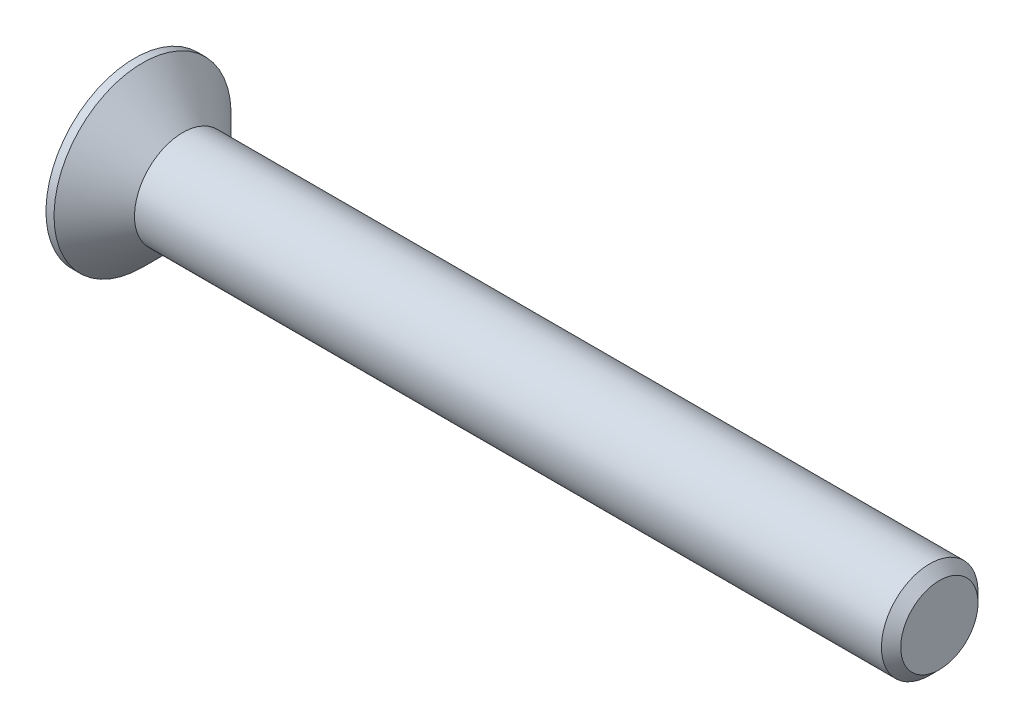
from build123d import *

# Parameters (mm, degrees)
CHAMFER1_SIZE      = 0.6
CUT_EXTRUDE1_DEPTH = 2.5


with BuildPart() as part:
    # Sketch1 → Revolve1 (revolve)
    with BuildSketch(Plane.XY, mode=Mode.PRIVATE) as revolve1_sk:
        Polygon((-3, 5.5), (-3, 0), (47, 0), (47, 3), (0, 3), (-2.5, 5.5), align=None)
    revolve(revolve1_sk.sketch.rotate(Axis((-3, 0, 0), (1, 0, 0)), 180), axis=Axis((-3, 0, 0), (1, 0, 0)))

    # Chamfer1
    chamfer1_edges = [part.edges().sort_by_distance(p)[0] for p in [
        (47, 3, 0),
    ]]
    chamfer(chamfer1_edges, length=CHAMFER1_SIZE)

    # Sketch2 → Cut-Extrude1 (cut)
    with BuildSketch(Plane.ZY.offset(3)):
        Polygon((-0.825, 3.3), (0.825, 3.3), (0.825, 0.825), (3.3, 0.825), (3.3, -0.825), (0.825, -0.825), (0.825, -3.3), (-0.825, -3.3), (-0.825, -0.825), (-3.3, -0.825), (-3.3, 0.825), (-0.825, 0.825), align=None)
    extrude(amount=-CUT_EXTRUDE1_DEPTH, mode=Mode.SUBTRACT)


solid = part.part
